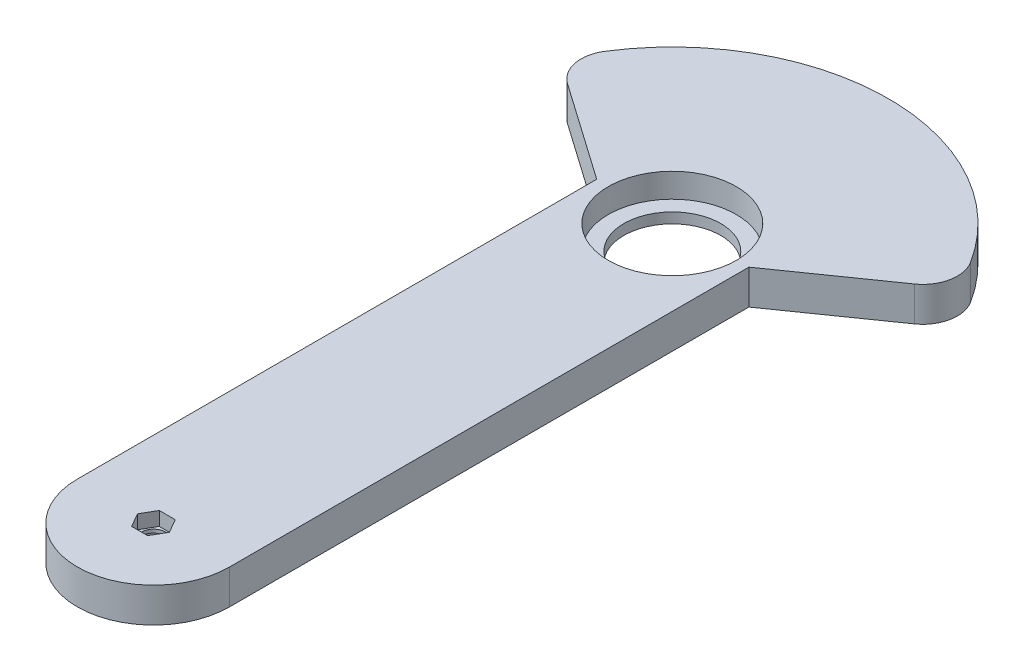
ISO-10303-21;
HEADER;
FILE_DESCRIPTION(('STEP AP214'),'2;1');
FILE_NAME('part.step','',(''),(''),'','','');
FILE_SCHEMA(('AUTOMOTIVE_DESIGN { 1 0 10303 214 1 1 1 1 }'));
ENDSEC;
DATA;
#1=APPLICATION_CONTEXT('core data for automotive mechanical design processes');
#2=APPLICATION_PROTOCOL_DEFINITION('international standard','automotive_design',2000,#1);
#3=PRODUCT_CONTEXT('',#1,'mechanical');
#4=PRODUCT('Part','Part','',(#3));
#5=PRODUCT_RELATED_PRODUCT_CATEGORY('part','',(#4));
#6=PRODUCT_DEFINITION_FORMATION('','',#4);
#7=PRODUCT_DEFINITION_CONTEXT('part definition',#1,'design');
#8=PRODUCT_DEFINITION('design','',#6,#7);
#9=PRODUCT_DEFINITION_SHAPE('','',#8);
#10=(LENGTH_UNIT() NAMED_UNIT(*) SI_UNIT(.MILLI.,.METRE.));
#11=(NAMED_UNIT(*) PLANE_ANGLE_UNIT() SI_UNIT($,.RADIAN.));
#12=(NAMED_UNIT(*) SI_UNIT($,.STERADIAN.) SOLID_ANGLE_UNIT());
#13=UNCERTAINTY_MEASURE_WITH_UNIT(LENGTH_MEASURE(1.E-05),#10,'distance_accuracy_value','');
#14=(GEOMETRIC_REPRESENTATION_CONTEXT(3) GLOBAL_UNCERTAINTY_ASSIGNED_CONTEXT((#13)) GLOBAL_UNIT_ASSIGNED_CONTEXT((#10,
#11,#12)) REPRESENTATION_CONTEXT('',''));
#15=CARTESIAN_POINT('',(0.,0.,0.));
#16=DIRECTION('',(0.,0.,1.));
#17=DIRECTION('',(1.,0.,0.));
#18=AXIS2_PLACEMENT_3D('',#15,#16,#17);
#19=CARTESIAN_POINT('',(0.,0.,150.));
#20=DIRECTION('',(0.,1.,0.));
#21=DIRECTION('',(0.,0.,1.));
#22=AXIS2_PLACEMENT_3D('',#19,#20,#21);
#23=CYLINDRICAL_SURFACE('',#22,3.5);
#24=CARTESIAN_POINT('',(0.,5.,150.));
#25=DIRECTION('',(0.,-1.,0.));
#26=DIRECTION('',(0.,0.,-1.));
#27=AXIS2_PLACEMENT_3D('',#24,#25,#26);
#28=CIRCLE('',#27,3.5);
#29=CARTESIAN_POINT('',(0.,5.,146.5));
#30=VERTEX_POINT('',#29);
#31=EDGE_CURVE('E196',#30,#30,#28,.F.);
#32=ORIENTED_EDGE('',*,*,#31,.F.);
#33=EDGE_LOOP('',(#32));
#34=FACE_BOUND('',#33,.T.);
#35=CARTESIAN_POINT('',(0.,6.,150.));
#36=DIRECTION('',(0.,1.,0.));
#37=DIRECTION('',(0.,0.,1.));
#38=AXIS2_PLACEMENT_3D('',#35,#36,#37);
#39=CIRCLE('',#38,3.5);
#40=CARTESIAN_POINT('',(0.,6.,153.5));
#41=VERTEX_POINT('',#40);
#42=EDGE_CURVE('E40',#41,#41,#39,.F.);
#43=ORIENTED_EDGE('',*,*,#42,.F.);
#44=EDGE_LOOP('',(#43));
#45=FACE_BOUND('',#44,.T.);
#46=ADVANCED_FACE('F36',(#34,#45),#23,.F.);
#47=CARTESIAN_POINT('',(-50.1264010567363,10.,-19.8392015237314));
#48=DIRECTION('',(0.573576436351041,0.,-0.819152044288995));
#49=DIRECTION('',(-0.819152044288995,0.,-0.573576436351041));
#50=AXIS2_PLACEMENT_3D('',#47,#48,#49);
#51=PLANE('',#50);
#52=DIRECTION('',(0.,-1.,0.));
#53=VECTOR('',#52,1.);
#54=CARTESIAN_POINT('',(-22.,10.,-0.144883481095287));
#55=LINE('',#54,#53);
#56=CARTESIAN_POINT('',(-22.,10.,-0.144883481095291));
#57=VERTEX_POINT('',#56);
#58=CARTESIAN_POINT('',(-22.,0.,-0.144883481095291));
#59=VERTEX_POINT('',#58);
#60=EDGE_CURVE('E231',#57,#59,#55,.T.);
#61=ORIENTED_EDGE('',*,*,#60,.F.);
#62=DIRECTION('',(0.819152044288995,0.,0.573576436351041));
#63=VECTOR('',#62,1.);
#64=CARTESIAN_POINT('',(-50.1264010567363,10.,-19.8392015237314));
#65=LINE('',#64,#63);
#66=CARTESIAN_POINT('',(-50.1264010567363,10.,-19.8392015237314));
#67=VERTEX_POINT('',#66);
#68=EDGE_CURVE('E244',#67,#57,#65,.T.);
#69=ORIENTED_EDGE('',*,*,#68,.F.);
#70=DIRECTION('',(0.,-1.,0.));
#71=VECTOR('',#70,1.);
#72=CARTESIAN_POINT('',(-50.1264010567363,10.,-19.8392015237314));
#73=LINE('',#72,#71);
#74=CARTESIAN_POINT('',(-50.1264010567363,0.,-19.8392015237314));
#75=VERTEX_POINT('',#74);
#76=EDGE_CURVE('E11',#67,#75,#73,.T.);
#77=ORIENTED_EDGE('',*,*,#76,.T.);
#78=DIRECTION('',(0.819152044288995,0.,0.573576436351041));
#79=VECTOR('',#78,1.);
#80=CARTESIAN_POINT('',(-50.1264010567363,0.,-19.8392015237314));
#81=LINE('',#80,#79);
#82=EDGE_CURVE('E239',#75,#59,#81,.T.);
#83=ORIENTED_EDGE('',*,*,#82,.T.);
#84=EDGE_LOOP('',(#61,#69,#77,#83));
#85=FACE_BOUND('',#84,.T.);
#86=ADVANCED_FACE('F272',(#85),#51,.F.);
#87=CARTESIAN_POINT('',(50.1264010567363,10.,-19.8392015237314));
#88=DIRECTION('',(0.573576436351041,0.,0.819152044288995));
#89=DIRECTION('',(0.819152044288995,0.,-0.573576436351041));
#90=AXIS2_PLACEMENT_3D('',#87,#88,#89);
#91=PLANE('',#90);
#92=DIRECTION('',(-0.819152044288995,0.,0.573576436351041));
#93=VECTOR('',#92,1.);
#94=CARTESIAN_POINT('',(50.1264010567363,10.,-19.8392015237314));
#95=LINE('',#94,#93);
#96=CARTESIAN_POINT('',(50.1264010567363,10.,-19.8392015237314));
#97=VERTEX_POINT('',#96);
#98=CARTESIAN_POINT('',(22.,10.,-0.144883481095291));
#99=VERTEX_POINT('',#98);
#100=EDGE_CURVE('E61',#97,#99,#95,.T.);
#101=ORIENTED_EDGE('',*,*,#100,.T.);
#102=DIRECTION('',(0.,-1.,0.));
#103=VECTOR('',#102,1.);
#104=CARTESIAN_POINT('',(22.,10.,-0.144883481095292));
#105=LINE('',#104,#103);
#106=CARTESIAN_POINT('',(22.,0.,-0.144883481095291));
#107=VERTEX_POINT('',#106);
#108=EDGE_CURVE('E218',#99,#107,#105,.T.);
#109=ORIENTED_EDGE('',*,*,#108,.T.);
#110=DIRECTION('',(-0.819152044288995,0.,0.573576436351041));
#111=VECTOR('',#110,1.);
#112=CARTESIAN_POINT('',(50.1264010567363,0.,-19.8392015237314));
#113=LINE('',#112,#111);
#114=CARTESIAN_POINT('',(50.1264010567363,0.,-19.8392015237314));
#115=VERTEX_POINT('',#114);
#116=EDGE_CURVE('E255',#115,#107,#113,.T.);
#117=ORIENTED_EDGE('',*,*,#116,.F.);
#118=DIRECTION('',(0.,-1.,0.));
#119=VECTOR('',#118,1.);
#120=CARTESIAN_POINT('',(50.1264010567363,10.,-19.8392015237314));
#121=LINE('',#120,#119);
#122=EDGE_CURVE('E45',#97,#115,#121,.T.);
#123=ORIENTED_EDGE('',*,*,#122,.F.);
#124=EDGE_LOOP('',(#101,#109,#117,#123));
#125=FACE_BOUND('',#124,.T.);
#126=ADVANCED_FACE('F343',(#125),#91,.T.);
#127=CARTESIAN_POINT('',(-44.3906366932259,10.,-28.0307219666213));
#128=DIRECTION('',(0.,-1.,0.));
#129=DIRECTION('',(0.,0.,-1.));
#130=AXIS2_PLACEMENT_3D('',#127,#128,#129);
#131=CYLINDRICAL_SURFACE('',#130,10.);
#132=CARTESIAN_POINT('',(-44.3906366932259,0.,-28.0307219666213));
#133=DIRECTION('',(0.,-1.,0.));
#134=DIRECTION('',(0.,0.,-1.));
#135=AXIS2_PLACEMENT_3D('',#132,#133,#134);
#136=CIRCLE('',#135,10.);
#137=CARTESIAN_POINT('',(-52.8459960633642,0.,-33.3699071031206));
#138=VERTEX_POINT('',#137);
#139=EDGE_CURVE('E234',#75,#138,#136,.T.);
#140=ORIENTED_EDGE('',*,*,#139,.F.);
#141=ORIENTED_EDGE('',*,*,#76,.F.);
#142=CARTESIAN_POINT('',(-44.3906366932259,10.,-28.0307219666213));
#143=DIRECTION('',(0.,-1.,0.));
#144=DIRECTION('',(0.,0.,-1.));
#145=AXIS2_PLACEMENT_3D('',#142,#143,#144);
#146=CIRCLE('',#145,10.);
#147=CARTESIAN_POINT('',(-52.8459960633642,10.,-33.3699071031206));
#148=VERTEX_POINT('',#147);
#149=EDGE_CURVE('E235',#67,#148,#146,.T.);
#150=ORIENTED_EDGE('',*,*,#149,.T.);
#151=DIRECTION('',(0.,-1.,0.));
#152=VECTOR('',#151,1.);
#153=CARTESIAN_POINT('',(-52.8459960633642,10.,-33.3699071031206));
#154=LINE('',#153,#152);
#155=EDGE_CURVE('E247',#148,#138,#154,.T.);
#156=ORIENTED_EDGE('',*,*,#155,.T.);
#157=EDGE_LOOP('',(#140,#141,#150,#156));
#158=FACE_BOUND('',#157,.T.);
#159=ADVANCED_FACE('F38',(#158),#131,.T.);
#160=CARTESIAN_POINT('',(44.3906366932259,10.,-28.0307219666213));
#161=DIRECTION('',(0.,-1.,0.));
#162=DIRECTION('',(0.,0.,-1.));
#163=AXIS2_PLACEMENT_3D('',#160,#161,#162);
#164=CYLINDRICAL_SURFACE('',#163,10.);
#165=CARTESIAN_POINT('',(44.3906366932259,0.,-28.0307219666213));
#166=DIRECTION('',(0.,1.,0.));
#167=DIRECTION('',(0.,0.,1.));
#168=AXIS2_PLACEMENT_3D('',#165,#166,#167);
#169=CIRCLE('',#168,10.);
#170=CARTESIAN_POINT('',(52.8459960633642,0.,-33.3699071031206));
#171=VERTEX_POINT('',#170);
#172=EDGE_CURVE('E253',#115,#171,#169,.T.);
#173=ORIENTED_EDGE('',*,*,#172,.T.);
#174=DIRECTION('',(0.,-1.,0.));
#175=VECTOR('',#174,1.);
#176=CARTESIAN_POINT('',(52.8459960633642,10.,-33.3699071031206));
#177=LINE('',#176,#175);
#178=CARTESIAN_POINT('',(52.8459960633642,10.,-33.3699071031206));
#179=VERTEX_POINT('',#178);
#180=EDGE_CURVE('E260',#179,#171,#177,.T.);
#181=ORIENTED_EDGE('',*,*,#180,.F.);
#182=CARTESIAN_POINT('',(44.3906366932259,10.,-28.0307219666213));
#183=DIRECTION('',(0.,1.,0.));
#184=DIRECTION('',(0.,0.,1.));
#185=AXIS2_PLACEMENT_3D('',#182,#183,#184);
#186=CIRCLE('',#185,10.);
#187=EDGE_CURVE('E241',#97,#179,#186,.T.);
#188=ORIENTED_EDGE('',*,*,#187,.F.);
#189=ORIENTED_EDGE('',*,*,#122,.T.);
#190=EDGE_LOOP('',(#173,#181,#188,#189));
#191=FACE_BOUND('',#190,.T.);
#192=ADVANCED_FACE('F347',(#191),#164,.T.);
#193=CARTESIAN_POINT('',(0.,10.,0.));
#194=DIRECTION('',(0.,-1.,0.));
#195=DIRECTION('',(0.,0.,-1.));
#196=AXIS2_PLACEMENT_3D('',#193,#194,#195);
#197=CYLINDRICAL_SURFACE('',#196,62.5);
#198=CARTESIAN_POINT('',(0.,0.,0.));
#199=DIRECTION('',(0.,1.,0.));
#200=DIRECTION('',(0.,0.,1.));
#201=AXIS2_PLACEMENT_3D('',#198,#199,#200);
#202=CIRCLE('',#201,62.5);
#203=EDGE_CURVE('E250',#171,#138,#202,.T.);
#204=ORIENTED_EDGE('',*,*,#203,.T.);
#205=ORIENTED_EDGE('',*,*,#155,.F.);
#206=CARTESIAN_POINT('',(0.,10.,0.));
#207=DIRECTION('',(0.,1.,0.));
#208=DIRECTION('',(0.,0.,1.));
#209=AXIS2_PLACEMENT_3D('',#206,#207,#208);
#210=CIRCLE('',#209,62.5);
#211=EDGE_CURVE('E238',#179,#148,#210,.T.);
#212=ORIENTED_EDGE('',*,*,#211,.F.);
#213=ORIENTED_EDGE('',*,*,#180,.T.);
#214=EDGE_LOOP('',(#204,#205,#212,#213));
#215=FACE_BOUND('',#214,.T.);
#216=ADVANCED_FACE('F336',(#215),#197,.T.);
#217=CARTESIAN_POINT('',(-44.3906366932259,10.,-28.0307219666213));
#218=DIRECTION('',(0.,-1.,0.));
#219=DIRECTION('',(0.,0.,-1.));
#220=AXIS2_PLACEMENT_3D('',#217,#218,#219);
#221=PLANE('',#220);
#222=DIRECTION('',(-0.5,0.,-0.866025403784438));
#223=VECTOR('',#222,1.);
#224=CARTESIAN_POINT('',(4.61880215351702,10.,150.));
#225=LINE('',#224,#223);
#226=CARTESIAN_POINT('',(4.61880215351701,10.,150.));
#227=VERTEX_POINT('',#226);
#228=CARTESIAN_POINT('',(2.30940107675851,10.,146.));
#229=VERTEX_POINT('',#228);
#230=EDGE_CURVE('E174',#227,#229,#225,.T.);
#231=ORIENTED_EDGE('',*,*,#230,.F.);
#232=DIRECTION('',(0.499999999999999,0.,-0.866025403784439));
#233=VECTOR('',#232,1.);
#234=CARTESIAN_POINT('',(2.3094010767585,10.,154.));
#235=LINE('',#234,#233);
#236=CARTESIAN_POINT('',(2.3094010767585,10.,154.));
#237=VERTEX_POINT('',#236);
#238=EDGE_CURVE('E53',#237,#227,#235,.T.);
#239=ORIENTED_EDGE('',*,*,#238,.F.);
#240=DIRECTION('',(1.,0.,0.));
#241=VECTOR('',#240,1.);
#242=CARTESIAN_POINT('',(-2.30940107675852,10.,154.));
#243=LINE('',#242,#241);
#244=CARTESIAN_POINT('',(-2.30940107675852,10.,154.));
#245=VERTEX_POINT('',#244);
#246=EDGE_CURVE('E160',#245,#237,#243,.T.);
#247=ORIENTED_EDGE('',*,*,#246,.F.);
#248=DIRECTION('',(0.500000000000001,0.,0.866025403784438));
#249=VECTOR('',#248,1.);
#250=CARTESIAN_POINT('',(-4.61880215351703,10.,150.));
#251=LINE('',#250,#249);
#252=CARTESIAN_POINT('',(-4.61880215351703,10.,150.));
#253=VERTEX_POINT('',#252);
#254=EDGE_CURVE('E163',#253,#245,#251,.T.);
#255=ORIENTED_EDGE('',*,*,#254,.F.);
#256=DIRECTION('',(-0.499999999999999,0.,0.86602540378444));
#257=VECTOR('',#256,1.);
#258=CARTESIAN_POINT('',(-2.30940107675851,10.,146.));
#259=LINE('',#258,#257);
#260=CARTESIAN_POINT('',(-2.30940107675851,10.,146.));
#261=VERTEX_POINT('',#260);
#262=EDGE_CURVE('E179',#261,#253,#259,.T.);
#263=ORIENTED_EDGE('',*,*,#262,.F.);
#264=DIRECTION('',(-1.,0.,0.));
#265=VECTOR('',#264,1.);
#266=CARTESIAN_POINT('',(2.30940107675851,10.,146.));
#267=LINE('',#266,#265);
#268=EDGE_CURVE('E176',#229,#261,#267,.T.);
#269=ORIENTED_EDGE('',*,*,#268,.F.);
#270=EDGE_LOOP('',(#231,#239,#247,#255,#263,#269));
#271=FACE_BOUND('',#270,.T.);
#272=CARTESIAN_POINT('',(0.,10.,0.));
#273=DIRECTION('',(0.,1.,0.));
#274=DIRECTION('',(0.,0.,1.));
#275=AXIS2_PLACEMENT_3D('',#272,#273,#274);
#276=CIRCLE('',#275,18.5);
#277=CARTESIAN_POINT('',(0.,10.,18.5));
#278=VERTEX_POINT('',#277);
#279=EDGE_CURVE('E208',#278,#278,#276,.T.);
#280=ORIENTED_EDGE('',*,*,#279,.F.);
#281=EDGE_LOOP('',(#280));
#282=FACE_BOUND('',#281,.T.);
#283=ORIENTED_EDGE('',*,*,#68,.T.);
#284=DIRECTION('',(0.,0.,1.));
#285=VECTOR('',#284,1.);
#286=CARTESIAN_POINT('',(-22.,10.,-0.144883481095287));
#287=LINE('',#286,#285);
#288=CARTESIAN_POINT('',(-22.,10.,150.));
#289=VERTEX_POINT('',#288);
#290=EDGE_CURVE('E211',#57,#289,#287,.T.);
#291=ORIENTED_EDGE('',*,*,#290,.T.);
#292=CARTESIAN_POINT('',(0.,10.,150.));
#293=DIRECTION('',(0.,1.,0.));
#294=DIRECTION('',(0.,0.,1.));
#295=AXIS2_PLACEMENT_3D('',#292,#293,#294);
#296=CIRCLE('',#295,22.);
#297=CARTESIAN_POINT('',(22.,10.,150.));
#298=VERTEX_POINT('',#297);
#299=EDGE_CURVE('E213',#289,#298,#296,.T.);
#300=ORIENTED_EDGE('',*,*,#299,.T.);
#301=DIRECTION('',(0.,0.,-1.));
#302=VECTOR('',#301,1.);
#303=CARTESIAN_POINT('',(22.,10.,-0.144883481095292));
#304=LINE('',#303,#302);
#305=EDGE_CURVE('E216',#298,#99,#304,.T.);
#306=ORIENTED_EDGE('',*,*,#305,.T.);
#307=ORIENTED_EDGE('',*,*,#100,.F.);
#308=ORIENTED_EDGE('',*,*,#187,.T.);
#309=ORIENTED_EDGE('',*,*,#211,.T.);
#310=ORIENTED_EDGE('',*,*,#149,.F.);
#311=EDGE_LOOP('',(#283,#291,#300,#306,#307,#308,#309,#310));
#312=FACE_BOUND('',#311,.T.);
#313=ADVANCED_FACE('F333',(#271,#282,#312),#221,.F.);
#314=CARTESIAN_POINT('',(-44.3906366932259,0.,-28.0307219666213));
#315=DIRECTION('',(0.,-1.,0.));
#316=DIRECTION('',(0.,0.,-1.));
#317=AXIS2_PLACEMENT_3D('',#314,#315,#316);
#318=PLANE('',#317);
#319=CARTESIAN_POINT('',(0.,0.,150.));
#320=DIRECTION('',(0.,-1.,0.));
#321=DIRECTION('',(0.,0.,-1.));
#322=AXIS2_PLACEMENT_3D('',#319,#320,#321);
#323=CIRCLE('',#322,8.);
#324=CARTESIAN_POINT('',(0.,0.,142.));
#325=VERTEX_POINT('',#324);
#326=EDGE_CURVE('E197',#325,#325,#323,.T.);
#327=ORIENTED_EDGE('',*,*,#326,.F.);
#328=EDGE_LOOP('',(#327));
#329=FACE_BOUND('',#328,.T.);
#330=CARTESIAN_POINT('',(0.,0.,0.));
#331=DIRECTION('',(0.,1.,0.));
#332=DIRECTION('',(0.,0.,1.));
#333=AXIS2_PLACEMENT_3D('',#330,#331,#332);
#334=CIRCLE('',#333,14.);
#335=CARTESIAN_POINT('',(0.,0.,14.));
#336=VERTEX_POINT('',#335);
#337=EDGE_CURVE('E200',#336,#336,#334,.T.);
#338=ORIENTED_EDGE('',*,*,#337,.T.);
#339=EDGE_LOOP('',(#338));
#340=FACE_BOUND('',#339,.T.);
#341=DIRECTION('',(0.,0.,1.));
#342=VECTOR('',#341,1.);
#343=CARTESIAN_POINT('',(-22.,0.,-0.144883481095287));
#344=LINE('',#343,#342);
#345=CARTESIAN_POINT('',(-22.,0.,150.));
#346=VERTEX_POINT('',#345);
#347=EDGE_CURVE('E207',#59,#346,#344,.T.);
#348=ORIENTED_EDGE('',*,*,#347,.F.);
#349=ORIENTED_EDGE('',*,*,#82,.F.);
#350=ORIENTED_EDGE('',*,*,#139,.T.);
#351=ORIENTED_EDGE('',*,*,#203,.F.);
#352=ORIENTED_EDGE('',*,*,#172,.F.);
#353=ORIENTED_EDGE('',*,*,#116,.T.);
#354=DIRECTION('',(0.,0.,-1.));
#355=VECTOR('',#354,1.);
#356=CARTESIAN_POINT('',(22.,0.,-0.144883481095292));
#357=LINE('',#356,#355);
#358=CARTESIAN_POINT('',(22.,0.,150.));
#359=VERTEX_POINT('',#358);
#360=EDGE_CURVE('E214',#359,#107,#357,.T.);
#361=ORIENTED_EDGE('',*,*,#360,.F.);
#362=CARTESIAN_POINT('',(0.,0.,150.));
#363=DIRECTION('',(0.,1.,0.));
#364=DIRECTION('',(0.,0.,1.));
#365=AXIS2_PLACEMENT_3D('',#362,#363,#364);
#366=CIRCLE('',#365,22.);
#367=EDGE_CURVE('E220',#346,#359,#366,.T.);
#368=ORIENTED_EDGE('',*,*,#367,.F.);
#369=EDGE_LOOP('',(#348,#349,#350,#351,#352,#353,#361,#368));
#370=FACE_BOUND('',#369,.T.);
#371=ADVANCED_FACE('F331',(#329,#340,#370),#318,.T.);
#372=CARTESIAN_POINT('',(-22.,10.,-0.144883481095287));
#373=DIRECTION('',(1.,0.,0.));
#374=DIRECTION('',(0.,0.,-1.));
#375=AXIS2_PLACEMENT_3D('',#372,#373,#374);
#376=PLANE('',#375);
#377=ORIENTED_EDGE('',*,*,#347,.T.);
#378=DIRECTION('',(0.,-1.,0.));
#379=VECTOR('',#378,1.);
#380=CARTESIAN_POINT('',(-22.,10.,150.));
#381=LINE('',#380,#379);
#382=EDGE_CURVE('E228',#289,#346,#381,.T.);
#383=ORIENTED_EDGE('',*,*,#382,.F.);
#384=ORIENTED_EDGE('',*,*,#290,.F.);
#385=ORIENTED_EDGE('',*,*,#60,.T.);
#386=EDGE_LOOP('',(#377,#383,#384,#385));
#387=FACE_BOUND('',#386,.T.);
#388=ADVANCED_FACE('F327',(#387),#376,.F.);
#389=CARTESIAN_POINT('',(0.,10.,150.));
#390=DIRECTION('',(0.,-1.,0.));
#391=DIRECTION('',(0.,0.,-1.));
#392=AXIS2_PLACEMENT_3D('',#389,#390,#391);
#393=CYLINDRICAL_SURFACE('',#392,22.);
#394=ORIENTED_EDGE('',*,*,#367,.T.);
#395=DIRECTION('',(0.,-1.,0.));
#396=VECTOR('',#395,1.);
#397=CARTESIAN_POINT('',(22.,10.,150.));
#398=LINE('',#397,#396);
#399=EDGE_CURVE('E225',#298,#359,#398,.T.);
#400=ORIENTED_EDGE('',*,*,#399,.F.);
#401=ORIENTED_EDGE('',*,*,#299,.F.);
#402=ORIENTED_EDGE('',*,*,#382,.T.);
#403=EDGE_LOOP('',(#394,#400,#401,#402));
#404=FACE_BOUND('',#403,.T.);
#405=ADVANCED_FACE('F323',(#404),#393,.T.);
#406=CARTESIAN_POINT('',(22.,10.,-0.144883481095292));
#407=DIRECTION('',(-1.,0.,0.));
#408=DIRECTION('',(0.,0.,1.));
#409=AXIS2_PLACEMENT_3D('',#406,#407,#408);
#410=PLANE('',#409);
#411=ORIENTED_EDGE('',*,*,#360,.T.);
#412=ORIENTED_EDGE('',*,*,#108,.F.);
#413=ORIENTED_EDGE('',*,*,#305,.F.);
#414=ORIENTED_EDGE('',*,*,#399,.T.);
#415=EDGE_LOOP('',(#411,#412,#413,#414));
#416=FACE_BOUND('',#415,.T.);
#417=ADVANCED_FACE('F319',(#416),#410,.F.);
#418=CARTESIAN_POINT('',(0.,3.,0.));
#419=DIRECTION('',(0.,1.,0.));
#420=DIRECTION('',(0.,0.,1.));
#421=AXIS2_PLACEMENT_3D('',#418,#419,#420);
#422=CYLINDRICAL_SURFACE('',#421,18.5);
#423=CARTESIAN_POINT('',(0.,3.,0.));
#424=DIRECTION('',(0.,1.,0.));
#425=DIRECTION('',(0.,0.,1.));
#426=AXIS2_PLACEMENT_3D('',#423,#424,#425);
#427=CIRCLE('',#426,18.5);
#428=CARTESIAN_POINT('',(0.,3.,18.5));
#429=VERTEX_POINT('',#428);
#430=EDGE_CURVE('E204',#429,#429,#427,.T.);
#431=ORIENTED_EDGE('',*,*,#430,.F.);
#432=EDGE_LOOP('',(#431));
#433=FACE_BOUND('',#432,.T.);
#434=ORIENTED_EDGE('',*,*,#279,.T.);
#435=EDGE_LOOP('',(#434));
#436=FACE_BOUND('',#435,.T.);
#437=ADVANCED_FACE('F315',(#433,#436),#422,.F.);
#438=CARTESIAN_POINT('',(0.,3.,0.));
#439=DIRECTION('',(0.,1.,0.));
#440=DIRECTION('',(0.,0.,1.));
#441=AXIS2_PLACEMENT_3D('',#438,#439,#440);
#442=PLANE('',#441);
#443=CARTESIAN_POINT('',(0.,3.,0.));
#444=DIRECTION('',(0.,1.,0.));
#445=DIRECTION('',(0.,0.,1.));
#446=AXIS2_PLACEMENT_3D('',#443,#444,#445);
#447=CIRCLE('',#446,14.);
#448=CARTESIAN_POINT('',(0.,3.,14.));
#449=VERTEX_POINT('',#448);
#450=EDGE_CURVE('E203',#449,#449,#447,.T.);
#451=ORIENTED_EDGE('',*,*,#450,.F.);
#452=EDGE_LOOP('',(#451));
#453=FACE_BOUND('',#452,.T.);
#454=ORIENTED_EDGE('',*,*,#430,.T.);
#455=EDGE_LOOP('',(#454));
#456=FACE_BOUND('',#455,.T.);
#457=ADVANCED_FACE('F311',(#453,#456),#442,.T.);
#458=CARTESIAN_POINT('',(0.,0.,0.));
#459=DIRECTION('',(0.,1.,0.));
#460=DIRECTION('',(0.,0.,1.));
#461=AXIS2_PLACEMENT_3D('',#458,#459,#460);
#462=CYLINDRICAL_SURFACE('',#461,14.);
#463=ORIENTED_EDGE('',*,*,#450,.T.);
#464=EDGE_LOOP('',(#463));
#465=FACE_BOUND('',#464,.T.);
#466=ORIENTED_EDGE('',*,*,#337,.F.);
#467=EDGE_LOOP('',(#466));
#468=FACE_BOUND('',#467,.T.);
#469=ADVANCED_FACE('F306',(#465,#468),#462,.F.);
#470=CARTESIAN_POINT('',(0.,5.,150.));
#471=DIRECTION('',(0.,-1.,0.));
#472=DIRECTION('',(0.,0.,-1.));
#473=AXIS2_PLACEMENT_3D('',#470,#471,#472);
#474=PLANE('',#473);
#475=CARTESIAN_POINT('',(0.,5.,150.));
#476=DIRECTION('',(0.,-1.,0.));
#477=DIRECTION('',(0.,0.,-1.));
#478=AXIS2_PLACEMENT_3D('',#475,#476,#477);
#479=CIRCLE('',#478,8.);
#480=CARTESIAN_POINT('',(0.,5.,142.));
#481=VERTEX_POINT('',#480);
#482=EDGE_CURVE('E193',#481,#481,#479,.T.);
#483=ORIENTED_EDGE('',*,*,#482,.T.);
#484=EDGE_LOOP('',(#483));
#485=FACE_BOUND('',#484,.T.);
#486=ORIENTED_EDGE('',*,*,#31,.T.);
#487=EDGE_LOOP('',(#486));
#488=FACE_BOUND('',#487,.T.);
#489=ADVANCED_FACE('F268',(#485,#488),#474,.T.);
#490=CARTESIAN_POINT('',(0.,5.,150.));
#491=DIRECTION('',(0.,-1.,0.));
#492=DIRECTION('',(0.,0.,-1.));
#493=AXIS2_PLACEMENT_3D('',#490,#491,#492);
#494=CYLINDRICAL_SURFACE('',#493,8.);
#495=ORIENTED_EDGE('',*,*,#482,.F.);
#496=EDGE_LOOP('',(#495));
#497=FACE_BOUND('',#496,.T.);
#498=ORIENTED_EDGE('',*,*,#326,.T.);
#499=EDGE_LOOP('',(#498));
#500=FACE_BOUND('',#499,.T.);
#501=ADVANCED_FACE('F277',(#497,#500),#494,.F.);
#502=CARTESIAN_POINT('',(0.,6.,0.));
#503=DIRECTION('',(0.,1.,0.));
#504=DIRECTION('',(0.,0.,1.));
#505=AXIS2_PLACEMENT_3D('',#502,#503,#504);
#506=PLANE('',#505);
#507=DIRECTION('',(0.499999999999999,0.,-0.866025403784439));
#508=VECTOR('',#507,1.);
#509=CARTESIAN_POINT('',(2.3094010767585,6.,154.));
#510=LINE('',#509,#508);
#511=CARTESIAN_POINT('',(2.3094010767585,6.,154.));
#512=VERTEX_POINT('',#511);
#513=CARTESIAN_POINT('',(4.61880215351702,6.,150.));
#514=VERTEX_POINT('',#513);
#515=EDGE_CURVE('E140',#512,#514,#510,.T.);
#516=ORIENTED_EDGE('',*,*,#515,.T.);
#517=DIRECTION('',(-0.5,0.,-0.866025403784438));
#518=VECTOR('',#517,1.);
#519=CARTESIAN_POINT('',(4.61880215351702,6.,150.));
#520=LINE('',#519,#518);
#521=CARTESIAN_POINT('',(2.30940107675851,6.,146.));
#522=VERTEX_POINT('',#521);
#523=EDGE_CURVE('E149',#514,#522,#520,.T.);
#524=ORIENTED_EDGE('',*,*,#523,.T.);
#525=DIRECTION('',(-1.,0.,0.));
#526=VECTOR('',#525,1.);
#527=CARTESIAN_POINT('',(2.30940107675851,6.,146.));
#528=LINE('',#527,#526);
#529=CARTESIAN_POINT('',(-2.30940107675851,6.,146.));
#530=VERTEX_POINT('',#529);
#531=EDGE_CURVE('E154',#522,#530,#528,.T.);
#532=ORIENTED_EDGE('',*,*,#531,.T.);
#533=DIRECTION('',(-0.499999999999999,0.,0.86602540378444));
#534=VECTOR('',#533,1.);
#535=CARTESIAN_POINT('',(-2.30940107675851,6.,146.));
#536=LINE('',#535,#534);
#537=CARTESIAN_POINT('',(-4.61880215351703,6.,150.));
#538=VERTEX_POINT('',#537);
#539=EDGE_CURVE('E167',#530,#538,#536,.T.);
#540=ORIENTED_EDGE('',*,*,#539,.T.);
#541=DIRECTION('',(0.500000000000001,0.,0.866025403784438));
#542=VECTOR('',#541,1.);
#543=CARTESIAN_POINT('',(-4.61880215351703,6.,150.));
#544=LINE('',#543,#542);
#545=CARTESIAN_POINT('',(-2.30940107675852,6.,154.));
#546=VERTEX_POINT('',#545);
#547=EDGE_CURVE('E170',#538,#546,#544,.T.);
#548=ORIENTED_EDGE('',*,*,#547,.T.);
#549=DIRECTION('',(1.,0.,0.));
#550=VECTOR('',#549,1.);
#551=CARTESIAN_POINT('',(-2.30940107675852,6.,154.));
#552=LINE('',#551,#550);
#553=EDGE_CURVE('E146',#546,#512,#552,.T.);
#554=ORIENTED_EDGE('',*,*,#553,.T.);
#555=EDGE_LOOP('',(#516,#524,#532,#540,#548,#554));
#556=FACE_BOUND('',#555,.T.);
#557=ORIENTED_EDGE('',*,*,#42,.T.);
#558=EDGE_LOOP('',(#557));
#559=FACE_BOUND('',#558,.T.);
#560=ADVANCED_FACE('F156',(#556,#559),#506,.T.);
#561=CARTESIAN_POINT('',(2.3094010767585,6.,154.));
#562=DIRECTION('',(0.866025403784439,0.,0.499999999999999));
#563=DIRECTION('',(0.499999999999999,0.,-0.866025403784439));
#564=AXIS2_PLACEMENT_3D('',#561,#562,#563);
#565=PLANE('',#564);
#566=ORIENTED_EDGE('',*,*,#238,.T.);
#567=DIRECTION('',(0.,1.,0.));
#568=VECTOR('',#567,1.);
#569=CARTESIAN_POINT('',(4.61880215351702,6.,150.));
#570=LINE('',#569,#568);
#571=EDGE_CURVE('E136',#514,#227,#570,.T.);
#572=ORIENTED_EDGE('',*,*,#571,.F.);
#573=ORIENTED_EDGE('',*,*,#515,.F.);
#574=DIRECTION('',(0.,1.,0.));
#575=VECTOR('',#574,1.);
#576=CARTESIAN_POINT('',(2.3094010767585,6.,154.));
#577=LINE('',#576,#575);
#578=EDGE_CURVE('E184',#512,#237,#577,.T.);
#579=ORIENTED_EDGE('',*,*,#578,.T.);
#580=EDGE_LOOP('',(#566,#572,#573,#579));
#581=FACE_BOUND('',#580,.T.);
#582=ADVANCED_FACE('F138',(#581),#565,.F.);
#583=CARTESIAN_POINT('',(-2.30940107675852,6.,154.));
#584=DIRECTION('',(0.,0.,1.));
#585=DIRECTION('',(1.,0.,0.));
#586=AXIS2_PLACEMENT_3D('',#583,#584,#585);
#587=PLANE('',#586);
#588=ORIENTED_EDGE('',*,*,#246,.T.);
#589=ORIENTED_EDGE('',*,*,#578,.F.);
#590=ORIENTED_EDGE('',*,*,#553,.F.);
#591=DIRECTION('',(0.,1.,0.));
#592=VECTOR('',#591,1.);
#593=CARTESIAN_POINT('',(-2.30940107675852,6.,154.));
#594=LINE('',#593,#592);
#595=EDGE_CURVE('E186',#546,#245,#594,.T.);
#596=ORIENTED_EDGE('',*,*,#595,.T.);
#597=EDGE_LOOP('',(#588,#589,#590,#596));
#598=FACE_BOUND('',#597,.T.);
#599=ADVANCED_FACE('F283',(#598),#587,.F.);
#600=CARTESIAN_POINT('',(-4.61880215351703,6.,150.));
#601=DIRECTION('',(-0.866025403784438,0.,0.500000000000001));
#602=DIRECTION('',(0.500000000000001,0.,0.866025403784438));
#603=AXIS2_PLACEMENT_3D('',#600,#601,#602);
#604=PLANE('',#603);
#605=ORIENTED_EDGE('',*,*,#254,.T.);
#606=ORIENTED_EDGE('',*,*,#595,.F.);
#607=ORIENTED_EDGE('',*,*,#547,.F.);
#608=DIRECTION('',(0.,1.,0.));
#609=VECTOR('',#608,1.);
#610=CARTESIAN_POINT('',(-4.61880215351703,6.,150.));
#611=LINE('',#610,#609);
#612=EDGE_CURVE('E188',#538,#253,#611,.T.);
#613=ORIENTED_EDGE('',*,*,#612,.T.);
#614=EDGE_LOOP('',(#605,#606,#607,#613));
#615=FACE_BOUND('',#614,.T.);
#616=ADVANCED_FACE('F290',(#615),#604,.F.);
#617=CARTESIAN_POINT('',(-2.30940107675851,6.,146.));
#618=DIRECTION('',(-0.866025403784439,0.,-0.499999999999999));
#619=DIRECTION('',(-0.499999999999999,0.,0.86602540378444));
#620=AXIS2_PLACEMENT_3D('',#617,#618,#619);
#621=PLANE('',#620);
#622=ORIENTED_EDGE('',*,*,#262,.T.);
#623=ORIENTED_EDGE('',*,*,#612,.F.);
#624=ORIENTED_EDGE('',*,*,#539,.F.);
#625=DIRECTION('',(0.,1.,0.));
#626=VECTOR('',#625,1.);
#627=CARTESIAN_POINT('',(-2.30940107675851,6.,146.));
#628=LINE('',#627,#626);
#629=EDGE_CURVE('E190',#530,#261,#628,.T.);
#630=ORIENTED_EDGE('',*,*,#629,.T.);
#631=EDGE_LOOP('',(#622,#623,#624,#630));
#632=FACE_BOUND('',#631,.T.);
#633=ADVANCED_FACE('F294',(#632),#621,.F.);
#634=CARTESIAN_POINT('',(2.30940107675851,6.,146.));
#635=DIRECTION('',(0.,0.,-1.));
#636=DIRECTION('',(-1.,0.,0.));
#637=AXIS2_PLACEMENT_3D('',#634,#635,#636);
#638=PLANE('',#637);
#639=ORIENTED_EDGE('',*,*,#268,.T.);
#640=ORIENTED_EDGE('',*,*,#629,.F.);
#641=ORIENTED_EDGE('',*,*,#531,.F.);
#642=DIRECTION('',(0.,1.,0.));
#643=VECTOR('',#642,1.);
#644=CARTESIAN_POINT('',(2.30940107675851,6.,146.));
#645=LINE('',#644,#643);
#646=EDGE_CURVE('E145',#522,#229,#645,.T.);
#647=ORIENTED_EDGE('',*,*,#646,.T.);
#648=EDGE_LOOP('',(#639,#640,#641,#647));
#649=FACE_BOUND('',#648,.T.);
#650=ADVANCED_FACE('F298',(#649),#638,.F.);
#651=CARTESIAN_POINT('',(4.61880215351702,6.,150.));
#652=DIRECTION('',(0.866025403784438,0.,-0.500000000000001));
#653=DIRECTION('',(-0.500000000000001,0.,-0.866025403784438));
#654=AXIS2_PLACEMENT_3D('',#651,#652,#653);
#655=PLANE('',#654);
#656=ORIENTED_EDGE('',*,*,#230,.T.);
#657=ORIENTED_EDGE('',*,*,#646,.F.);
#658=ORIENTED_EDGE('',*,*,#523,.F.);
#659=ORIENTED_EDGE('',*,*,#571,.T.);
#660=EDGE_LOOP('',(#656,#657,#658,#659));
#661=FACE_BOUND('',#660,.T.);
#662=ADVANCED_FACE('F150',(#661),#655,.F.);
#663=CLOSED_SHELL('',(#46,#86,#126,#159,#192,#216,#313,#371,#388,#405,#417,#437,#457,#469,#489,
#501,#560,#582,#599,#616,#633,#650,#662));
#664=MANIFOLD_SOLID_BREP('B2',#663);
#665=ADVANCED_BREP_SHAPE_REPRESENTATION('',(#18,#664),#14);
#666=SHAPE_DEFINITION_REPRESENTATION(#9,#665);
ENDSEC;
END-ISO-10303-21;
